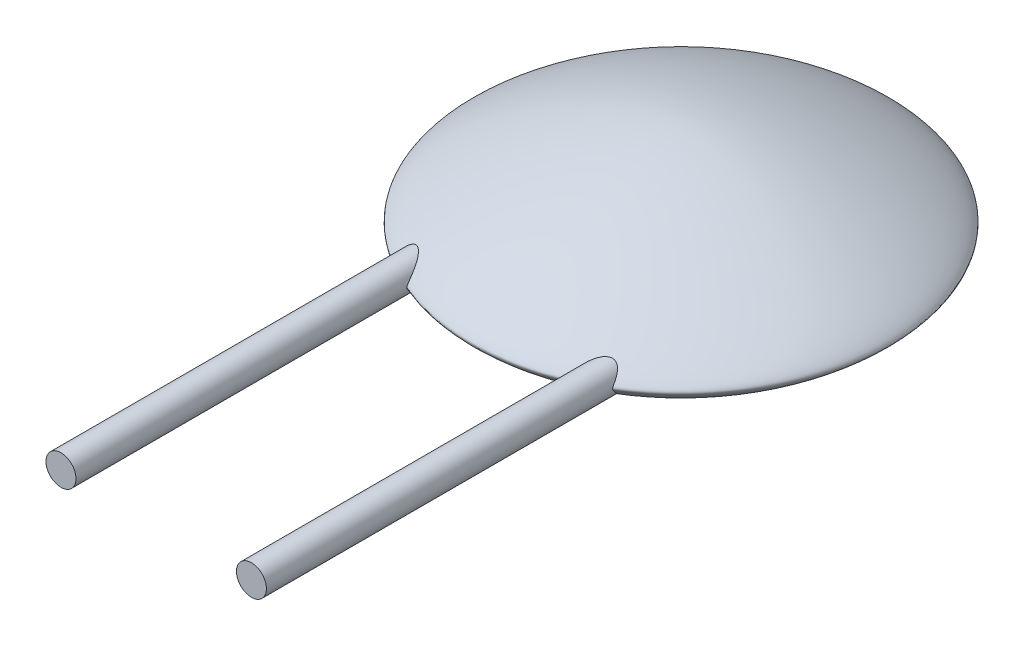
ISO-10303-21;
HEADER;
FILE_DESCRIPTION(('STEP AP214'),'2;1');
FILE_NAME('part.step','',(''),(''),'','','');
FILE_SCHEMA(('AUTOMOTIVE_DESIGN { 1 0 10303 214 1 1 1 1 }'));
ENDSEC;
DATA;
#1=APPLICATION_CONTEXT('core data for automotive mechanical design processes');
#2=APPLICATION_PROTOCOL_DEFINITION('international standard','automotive_design',2000,#1);
#3=PRODUCT_CONTEXT('',#1,'mechanical');
#4=PRODUCT('Part','Part','',(#3));
#5=PRODUCT_RELATED_PRODUCT_CATEGORY('part','',(#4));
#6=PRODUCT_DEFINITION_FORMATION('','',#4);
#7=PRODUCT_DEFINITION_CONTEXT('part definition',#1,'design');
#8=PRODUCT_DEFINITION('design','',#6,#7);
#9=PRODUCT_DEFINITION_SHAPE('','',#8);
#10=(LENGTH_UNIT() NAMED_UNIT(*) SI_UNIT(.MILLI.,.METRE.));
#11=(NAMED_UNIT(*) PLANE_ANGLE_UNIT() SI_UNIT($,.RADIAN.));
#12=(NAMED_UNIT(*) SI_UNIT($,.STERADIAN.) SOLID_ANGLE_UNIT());
#13=UNCERTAINTY_MEASURE_WITH_UNIT(LENGTH_MEASURE(1.E-05),#10,'distance_accuracy_value','');
#14=(GEOMETRIC_REPRESENTATION_CONTEXT(3) GLOBAL_UNCERTAINTY_ASSIGNED_CONTEXT((#13)) GLOBAL_UNIT_ASSIGNED_CONTEXT((#10,
#11,#12)) REPRESENTATION_CONTEXT('',''));
#15=CARTESIAN_POINT('',(0.,0.,0.));
#16=DIRECTION('',(0.,0.,1.));
#17=DIRECTION('',(1.,0.,0.));
#18=AXIS2_PLACEMENT_3D('',#15,#16,#17);
#19=CARTESIAN_POINT('',(0.,1.05,0.));
#20=CARTESIAN_POINT('',(-1.17248497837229,1.04999999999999,0.));
#21=CARTESIAN_POINT('',(-2.8,0.16193282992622,0.));
#22=CARTESIAN_POINT('',(-2.8,-0.16193282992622,0.));
#23=CARTESIAN_POINT('',(-1.2956675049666,-1.05,0.));
#24=CARTESIAN_POINT('',(0.,-1.05,0.));
#25=B_SPLINE_CURVE_WITH_KNOTS('',3,(#19,#20,#21,#22,#23,#24),.UNSPECIFIED.,.F.,.F.,(4,2,4),(0.,
0.5,1.),.UNSPECIFIED.);
#26=CARTESIAN_POINT('',(0.,1.05,0.));
#27=DIRECTION('',(0.,1.,0.));
#28=AXIS1_PLACEMENT('',#26,#27);
#29=SURFACE_OF_REVOLUTION('',#25,#28);
#30=CARTESIAN_POINT('',(1.47000000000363,0.,2.38308623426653));
#31=CARTESIAN_POINT('',(1.46999967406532,0.0037144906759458,2.3830677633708));
#32=CARTESIAN_POINT('',(1.46989144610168,0.00742089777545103,2.38215189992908));
#33=CARTESIAN_POINT('',(1.46947322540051,0.0151314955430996,2.3792964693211));
#34=CARTESIAN_POINT('',(1.4691278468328,0.0190516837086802,2.37719144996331));
#35=CARTESIAN_POINT('',(1.46825798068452,0.026604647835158,2.37252553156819));
#36=CARTESIAN_POINT('',(1.46773279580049,0.0302362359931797,2.36996287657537));
#37=CARTESIAN_POINT('',(1.46605837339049,0.0400254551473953,2.36251611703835));
#38=CARTESIAN_POINT('',(1.46474134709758,0.0459528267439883,2.35737566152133));
#39=CARTESIAN_POINT('',(1.46166454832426,0.0574419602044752,2.34682128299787));
#40=CARTESIAN_POINT('',(1.45990392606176,0.0630029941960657,2.34140685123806));
#41=CARTESIAN_POINT('',(1.45395505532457,0.0793507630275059,2.32499898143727));
#42=CARTESIAN_POINT('',(1.44910577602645,0.0897700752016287,2.31386955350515));
#43=CARTESIAN_POINT('',(1.43739431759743,0.110074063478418,2.29206232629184));
#44=CARTESIAN_POINT('',(1.43052219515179,0.119955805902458,2.28138706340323));
#45=CARTESIAN_POINT('',(1.41430596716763,0.139041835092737,2.2615025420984));
#46=CARTESIAN_POINT('',(1.40498460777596,0.148251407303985,2.25228098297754));
#47=CARTESIAN_POINT('',(1.38506181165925,0.163974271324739,2.23832270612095));
#48=CARTESIAN_POINT('',(1.37501084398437,0.170671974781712,2.23307313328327));
#49=CARTESIAN_POINT('',(1.35835411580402,0.179538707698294,2.22790199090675));
#50=CARTESIAN_POINT('',(1.35249504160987,0.18231176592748,2.2266295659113));
#51=CARTESIAN_POINT('',(1.34041669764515,0.187306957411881,2.22518087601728));
#52=CARTESIAN_POINT('',(1.33419785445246,0.189529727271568,2.22500333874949));
#53=CARTESIAN_POINT('',(1.32233866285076,0.193118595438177,2.2257422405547));
#54=CARTESIAN_POINT('',(1.31671079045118,0.194552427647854,2.22653934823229));
#55=CARTESIAN_POINT('',(1.30551924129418,0.19690411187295,2.22895871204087));
#56=CARTESIAN_POINT('',(1.29995570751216,0.197820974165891,2.23058253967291));
#57=CARTESIAN_POINT('',(1.28005556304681,0.200274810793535,2.23777048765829));
#58=CARTESIAN_POINT('',(1.26629751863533,0.200362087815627,2.24542884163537));
#59=CARTESIAN_POINT('',(1.24324630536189,0.198482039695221,2.26155224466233));
#60=CARTESIAN_POINT('',(1.23359562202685,0.196883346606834,2.26962107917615));
#61=CARTESIAN_POINT('',(1.21542939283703,0.192633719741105,2.28674149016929));
#62=CARTESIAN_POINT('',(1.20691674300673,0.189980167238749,2.29579547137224));
#63=CARTESIAN_POINT('',(1.18374390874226,0.18117867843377,2.32278046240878));
#64=CARTESIAN_POINT('',(1.17034619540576,0.174021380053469,2.34144767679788));
#65=CARTESIAN_POINT('',(1.14616991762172,0.157723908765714,2.37960538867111));
#66=CARTESIAN_POINT('',(1.13540091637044,0.148576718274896,2.39909859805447));
#67=CARTESIAN_POINT('',(1.11509610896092,0.127449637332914,2.44037694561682));
#68=CARTESIAN_POINT('',(1.10581030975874,0.115272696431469,2.46218689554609));
#69=CARTESIAN_POINT('',(1.09389818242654,0.0951199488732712,2.49440971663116));
#70=CARTESIAN_POINT('',(1.09026576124,0.0880944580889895,2.50505995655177));
#71=CARTESIAN_POINT('',(1.08371435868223,0.0732419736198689,2.52600950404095));
#72=CARTESIAN_POINT('',(1.08079413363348,0.0654164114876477,2.53630939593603));
#73=CARTESIAN_POINT('',(1.07695482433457,0.0524892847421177,2.5514477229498));
#74=CARTESIAN_POINT('',(1.07573914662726,0.0478290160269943,2.55658425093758));
#75=CARTESIAN_POINT('',(1.07358552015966,0.0380358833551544,2.56641055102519));
#76=CARTESIAN_POINT('',(1.07264620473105,0.0329055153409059,2.57110244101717));
#77=CARTESIAN_POINT('',(1.07134379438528,0.0234759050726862,2.57832353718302));
#78=CARTESIAN_POINT('',(1.07089242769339,0.0193812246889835,2.58108151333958));
#79=CARTESIAN_POINT('',(1.07043460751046,0.0132870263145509,2.58415881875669));
#80=CARTESIAN_POINT('',(1.07032479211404,0.0115353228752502,2.58493876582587));
#81=CARTESIAN_POINT('',(1.07014974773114,0.00794304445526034,2.58624351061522));
#82=CARTESIAN_POINT('',(1.07008425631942,0.00610306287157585,2.58676980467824));
#83=CARTESIAN_POINT('',(1.07001359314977,0.00275389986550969,2.58735975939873));
#84=CARTESIAN_POINT('',(1.0699984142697,0.00125960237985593,2.58749904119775));
#85=CARTESIAN_POINT('',(1.07000185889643,-0.00172709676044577,2.58747686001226));
#86=CARTESIAN_POINT('',(1.07002052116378,-0.00321949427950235,2.58731505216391));
#87=CARTESIAN_POINT('',(1.07010547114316,-0.0068427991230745,2.58665719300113));
#88=CARTESIAN_POINT('',(1.07018981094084,-0.00894936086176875,2.58604106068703));
#89=CARTESIAN_POINT('',(1.07041594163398,-0.0130559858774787,2.58451471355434));
#90=CARTESIAN_POINT('',(1.0705580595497,-0.0150553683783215,2.58360283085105));
#91=CARTESIAN_POINT('',(1.07118369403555,-0.0223954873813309,2.57982222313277));
#92=CARTESIAN_POINT('',(1.07182673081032,-0.0273977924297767,2.57634290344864));
#93=CARTESIAN_POINT('',(1.07337429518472,-0.0368965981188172,2.56882704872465));
#94=CARTESIAN_POINT('',(1.07427990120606,-0.0413909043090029,2.56478825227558));
#95=CARTESIAN_POINT('',(1.07689696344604,-0.0525418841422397,2.55395847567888));
#96=CARTESIAN_POINT('',(1.07877067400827,-0.058934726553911,2.54693376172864));
#97=CARTESIAN_POINT('',(1.08296877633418,-0.0711381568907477,2.5325168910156));
#98=CARTESIAN_POINT('',(1.08529412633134,-0.0769474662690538,2.52512397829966));
#99=CARTESIAN_POINT('',(1.09289308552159,-0.0937284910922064,2.50260626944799));
#100=CARTESIAN_POINT('',(1.09878018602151,-0.104017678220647,2.48718145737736));
#101=CARTESIAN_POINT('',(1.11571571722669,-0.128553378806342,2.44757864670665));
#102=CARTESIAN_POINT('',(1.12782102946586,-0.141858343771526,2.4232586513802));
#103=CARTESIAN_POINT('',(1.1488942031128,-0.159420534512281,2.38744991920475));
#104=CARTESIAN_POINT('',(1.15638184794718,-0.164864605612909,2.37565457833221));
#105=CARTESIAN_POINT('',(1.17246484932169,-0.174862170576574,2.35245794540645));
#106=CARTESIAN_POINT('',(1.1810595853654,-0.17941615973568,2.34105643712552));
#107=CARTESIAN_POINT('',(1.20245860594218,-0.18871992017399,2.31542838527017));
#108=CARTESIAN_POINT('',(1.21573949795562,-0.193087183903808,2.30143076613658));
#109=CARTESIAN_POINT('',(1.23785298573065,-0.197541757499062,2.28227030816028));
#110=CARTESIAN_POINT('',(1.24563867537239,-0.198677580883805,2.2761609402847));
#111=CARTESIAN_POINT('',(1.26196116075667,-0.200008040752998,2.26495020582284));
#112=CARTESIAN_POINT('',(1.27049599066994,-0.200205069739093,2.25984630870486));
#113=CARTESIAN_POINT('',(1.29106674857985,-0.199220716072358,2.24981534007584));
#114=CARTESIAN_POINT('',(1.30337730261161,-0.197601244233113,2.2454155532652));
#115=CARTESIAN_POINT('',(1.322007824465,-0.193228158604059,2.24175942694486));
#116=CARTESIAN_POINT('',(1.32827702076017,-0.191432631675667,2.24103517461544));
#117=CARTESIAN_POINT('',(1.34064007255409,-0.187223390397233,2.24063623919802));
#118=CARTESIAN_POINT('',(1.34673393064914,-0.18480968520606,2.24096154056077));
#119=CARTESIAN_POINT('',(1.36333291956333,-0.177272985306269,2.24329652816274));
#120=CARTESIAN_POINT('',(1.37340387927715,-0.171541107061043,2.24645906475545));
#121=CARTESIAN_POINT('',(1.39679225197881,-0.155646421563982,2.25743180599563));
#122=CARTESIAN_POINT('',(1.40880136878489,-0.144791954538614,2.26684846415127));
#123=CARTESIAN_POINT('',(1.42758368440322,-0.123835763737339,2.28631127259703));
#124=CARTESIAN_POINT('',(1.43486726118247,-0.113858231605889,2.29606099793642));
#125=CARTESIAN_POINT('',(1.44731853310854,-0.0932863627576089,2.31620778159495));
#126=CARTESIAN_POINT('',(1.45248991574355,-0.082693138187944,2.32660367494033));
#127=CARTESIAN_POINT('',(1.45847938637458,-0.067075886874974,2.34112770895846));
#128=CARTESIAN_POINT('',(1.46007249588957,-0.0624266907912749,2.34535823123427));
#129=CARTESIAN_POINT('',(1.46294836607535,-0.0528773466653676,2.35370298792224));
#130=CARTESIAN_POINT('',(1.46422918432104,-0.0479758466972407,2.35781636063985));
#131=CARTESIAN_POINT('',(1.46647252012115,-0.0377690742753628,2.36579903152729));
#132=CARTESIAN_POINT('',(1.46742991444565,-0.0324588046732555,2.36966368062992));
#133=CARTESIAN_POINT('',(1.46856250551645,-0.0240956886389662,2.37484731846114));
#134=CARTESIAN_POINT('',(1.46888858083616,-0.0212566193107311,2.3764664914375));
#135=CARTESIAN_POINT('',(1.46942805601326,-0.0154020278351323,2.37935633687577));
#136=CARTESIAN_POINT('',(1.46964161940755,-0.0123867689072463,2.38062751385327));
#137=CARTESIAN_POINT('',(1.46992461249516,-0.00623777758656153,2.38248569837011));
#138=CARTESIAN_POINT('',(1.47000027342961,-0.00311604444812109,2.3831017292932));
#139=CARTESIAN_POINT('',(1.47000000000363,0.,2.38308623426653));
#140=B_SPLINE_CURVE_WITH_KNOTS('',3,(#30,#31,#32,#33,#34,#35,#36,#37,#38,#39,#40,#41,#42,#43,
#44,#45,#46,#47,#48,#49,#50,#51,#52,#53,#54,#55,#56,#57,#58,#59,#60,#61,#62,#63,#64,#65,#66,#67,
#68,#69,#70,#71,#72,#73,#74,#75,#76,#77,#78,#79,#80,#81,#82,#83,#84,#85,#86,#87,#88,#89,#90,#91,
#92,#93,#94,#95,#96,#97,#98,#99,#100,#101,#102,#103,#104,#105,#106,#107,#108,#109,#110,#111,
#112,#113,#114,#115,#116,#117,#118,#119,#120,#121,#122,#123,#124,#125,#126,#127,#128,#129,#130,
#131,#132,#133,#134,#135,#136,#137,#138,#139),.UNSPECIFIED.,.T.,.F.,(4,2,2,2,2,2,2,2,2,2,2,2,2,
2,2,2,2,2,2,2,2,2,2,2,2,2,2,2,2,2,2,2,2,2,2,2,2,2,2,2,2,2,2,2,2,2,2,2,2,2,2,2,2,2,4),(0.,
0.0111621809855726,0.0245119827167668,0.0379141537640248,0.0617319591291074,0.0855957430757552,
0.13345252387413,0.181548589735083,0.22921287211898,0.268113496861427,0.287822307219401,
0.307508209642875,0.325007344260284,0.342539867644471,0.388830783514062,0.426752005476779,
0.464767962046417,0.536579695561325,0.608648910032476,0.688322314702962,0.728092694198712,
0.767793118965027,0.788895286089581,0.809891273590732,0.824662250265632,0.830411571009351,
0.83612654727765,0.840601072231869,0.845080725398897,0.851634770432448,0.858226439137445,
0.876465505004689,0.894780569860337,0.923755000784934,0.952791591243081,1.01102420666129,
1.10132900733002,1.146254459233,1.19115484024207,1.25006902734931,1.27985687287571,
1.30956876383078,1.34832979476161,1.36790587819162,1.38748167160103,1.42294649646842,
1.4781298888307,1.52519474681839,1.57217708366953,1.59162290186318,1.61118675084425,
1.63104737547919,1.64088142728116,1.65070114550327,1.66006497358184),.UNSPECIFIED.);
#141=CARTESIAN_POINT('',(1.47000000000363,0.,2.38308623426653));
#142=VERTEX_POINT('',#141);
#143=EDGE_CURVE('E11',#142,#142,#140,.T.);
#144=ORIENTED_EDGE('',*,*,#143,.F.);
#145=EDGE_LOOP('',(#144));
#146=FACE_BOUND('',#145,.T.);
#147=CARTESIAN_POINT('',(-1.07000000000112,0.,2.58748913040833));
#148=CARTESIAN_POINT('',(-1.07000007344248,0.0035103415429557,2.5874711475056));
#149=CARTESIAN_POINT('',(-1.0700971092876,0.00702169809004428,2.58662128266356));
#150=CARTESIAN_POINT('',(-1.07041537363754,0.0132211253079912,2.58427957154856));
#151=CARTESIAN_POINT('',(-1.07061950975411,0.0159572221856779,2.58288155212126));
#152=CARTESIAN_POINT('',(-1.07111315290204,0.0212332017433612,2.57975653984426));
#153=CARTESIAN_POINT('',(-1.07140274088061,0.0237728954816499,2.5780292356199));
#154=CARTESIAN_POINT('',(-1.07226853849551,0.0303236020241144,2.57315774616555));
#155=CARTESIAN_POINT('',(-1.07290725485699,0.0341892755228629,2.56983549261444));
#156=CARTESIAN_POINT('',(-1.07434210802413,0.0416192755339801,2.56289663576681));
#157=CARTESIAN_POINT('',(-1.07513856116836,0.0451829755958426,2.55927944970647));
#158=CARTESIAN_POINT('',(-1.07773991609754,0.0555649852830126,2.54812605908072));
#159=CARTESIAN_POINT('',(-1.07975131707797,0.0620379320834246,2.54031912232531));
#160=CARTESIAN_POINT('',(-1.08525949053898,0.0772174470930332,2.52073450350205));
#161=CARTESIAN_POINT('',(-1.08901458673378,0.0855886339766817,2.50877634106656));
#162=CARTESIAN_POINT('',(-1.09740659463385,0.101446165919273,2.48456948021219));
#163=CARTESIAN_POINT('',(-1.1020450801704,0.108930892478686,2.47232029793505));
#164=CARTESIAN_POINT('',(-1.11722017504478,0.130250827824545,2.4354907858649));
#165=CARTESIAN_POINT('',(-1.12903259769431,0.142993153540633,2.41077014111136));
#166=CARTESIAN_POINT('',(-1.15111463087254,0.161189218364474,2.3716400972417));
#167=CARTESIAN_POINT('',(-1.16019345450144,0.167548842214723,2.35696443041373));
#168=CARTESIAN_POINT('',(-1.1800307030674,0.178990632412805,2.32826965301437));
#169=CARTESIAN_POINT('',(-1.19078525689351,0.184075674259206,2.31424912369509));
#170=CARTESIAN_POINT('',(-1.20970824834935,0.190843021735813,2.29283846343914));
#171=CARTESIAN_POINT('',(-1.21719947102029,0.193073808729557,2.28503256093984));
#172=CARTESIAN_POINT('',(-1.23305361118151,0.196728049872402,2.27017658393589));
#173=CARTESIAN_POINT('',(-1.24141557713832,0.19815237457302,2.2631257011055));
#174=CARTESIAN_POINT('',(-1.26267378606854,0.200246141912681,2.24767217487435));
#175=CARTESIAN_POINT('',(-1.27607419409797,0.200411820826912,2.23979865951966));
#176=CARTESIAN_POINT('',(-1.29575451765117,0.198413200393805,2.23197621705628));
#177=CARTESIAN_POINT('',(-1.30141339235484,0.197603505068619,2.23011909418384));
#178=CARTESIAN_POINT('',(-1.31283467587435,0.195445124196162,2.22724673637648));
#179=CARTESIAN_POINT('',(-1.3185968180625,0.194097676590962,2.22622958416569));
#180=CARTESIAN_POINT('',(-1.33008757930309,0.190853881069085,2.22512623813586));
#181=CARTESIAN_POINT('',(-1.33581591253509,0.188954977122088,2.22504445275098));
#182=CARTESIAN_POINT('',(-1.34702183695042,0.184672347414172,2.22581464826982));
#183=CARTESIAN_POINT('',(-1.35249926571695,0.182288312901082,2.22666722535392));
#184=CARTESIAN_POINT('',(-1.37002044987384,0.1737242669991,2.23089411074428));
#185=CARTESIAN_POINT('',(-1.38120637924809,0.166681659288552,2.23611093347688));
#186=CARTESIAN_POINT('',(-1.39868029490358,0.15341313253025,2.24759147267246));
#187=CARTESIAN_POINT('',(-1.40550348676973,0.147367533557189,2.25334470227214));
#188=CARTESIAN_POINT('',(-1.41791099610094,0.134902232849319,2.26577636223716));
#189=CARTESIAN_POINT('',(-1.42349014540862,0.128481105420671,2.27245847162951));
#190=CARTESIAN_POINT('',(-1.43761563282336,0.110135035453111,2.29190207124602));
#191=CARTESIAN_POINT('',(-1.44496408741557,0.0979173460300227,2.30524975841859));
#192=CARTESIAN_POINT('',(-1.45393400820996,0.0788432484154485,2.32535242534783));
#193=CARTESIAN_POINT('',(-1.45658005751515,0.0723681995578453,2.3320593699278));
#194=CARTESIAN_POINT('',(-1.46122101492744,0.0590332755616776,2.34531240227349));
#195=CARTESIAN_POINT('',(-1.46321698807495,0.0521740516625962,2.35185873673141));
#196=CARTESIAN_POINT('',(-1.46549465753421,0.0422994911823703,2.36042809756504));
#197=CARTESIAN_POINT('',(-1.4660657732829,0.0395751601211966,2.36271014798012));
#198=CARTESIAN_POINT('',(-1.4671106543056,0.0339931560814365,2.36714635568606));
#199=CARTESIAN_POINT('',(-1.46758417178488,0.031135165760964,2.36930017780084));
#200=CARTESIAN_POINT('',(-1.46842632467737,0.0252180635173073,2.37340341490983));
#201=CARTESIAN_POINT('',(-1.46879397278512,0.0221573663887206,2.37535080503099));
#202=CARTESIAN_POINT('',(-1.46939989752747,0.0158115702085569,2.3788471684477));
#203=CARTESIAN_POINT('',(-1.46963868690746,0.0125274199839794,2.38039770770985));
#204=CARTESIAN_POINT('',(-1.469931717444,0.00601419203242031,2.38247631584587));
#205=CARTESIAN_POINT('',(-1.47000501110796,0.0028278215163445,2.38310651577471));
#206=CARTESIAN_POINT('',(-1.46999436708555,-0.00353345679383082,2.38306083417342));
#207=CARTESIAN_POINT('',(-1.46991006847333,-0.00670832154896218,2.38238195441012));
#208=CARTESIAN_POINT('',(-1.46956313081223,-0.0138448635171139,2.38012817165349));
#209=CARTESIAN_POINT('',(-1.46925001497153,-0.0177116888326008,2.37832858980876));
#210=CARTESIAN_POINT('',(-1.46844336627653,-0.0251832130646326,2.37425653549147));
#211=CARTESIAN_POINT('',(-1.4679489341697,-0.0287864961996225,2.37198173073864));
#212=CARTESIAN_POINT('',(-1.46639794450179,-0.0382737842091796,2.36549642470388));
#213=CARTESIAN_POINT('',(-1.46519107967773,-0.0439696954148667,2.36105420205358));
#214=CARTESIAN_POINT('',(-1.46236424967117,-0.0550296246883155,2.35189177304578));
#215=CARTESIAN_POINT('',(-1.46074350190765,-0.0603929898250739,2.34717105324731));
#216=CARTESIAN_POINT('',(-1.45526780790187,-0.0761632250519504,2.33284257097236));
#217=CARTESIAN_POINT('',(-1.45080312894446,-0.0862293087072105,2.3230852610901));
#218=CARTESIAN_POINT('',(-1.44008619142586,-0.105803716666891,2.30396115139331));
#219=CARTESIAN_POINT('',(-1.43383178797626,-0.115311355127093,2.29459483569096));
#220=CARTESIAN_POINT('',(-1.41921409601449,-0.133691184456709,2.2770416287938));
#221=CARTESIAN_POINT('',(-1.41086470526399,-0.142567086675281,2.26884750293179));
#222=CARTESIAN_POINT('',(-1.39194139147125,-0.158985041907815,2.25512818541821));
#223=CARTESIAN_POINT('',(-1.38149964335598,-0.166571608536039,2.24948998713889));
#224=CARTESIAN_POINT('',(-1.36404222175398,-0.176641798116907,2.2438627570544));
#225=CARTESIAN_POINT('',(-1.3578757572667,-0.179797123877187,2.24245903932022));
#226=CARTESIAN_POINT('',(-1.34511579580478,-0.185488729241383,2.24081779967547));
#227=CARTESIAN_POINT('',(-1.33852288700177,-0.188025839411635,2.24057870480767));
#228=CARTESIAN_POINT('',(-1.32599435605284,-0.192100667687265,2.24127714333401));
#229=CARTESIAN_POINT('',(-1.32007765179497,-0.193722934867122,2.24207354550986));
#230=CARTESIAN_POINT('',(-1.30828988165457,-0.196393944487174,2.24453539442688));
#231=CARTESIAN_POINT('',(-1.30241892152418,-0.197441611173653,2.24620245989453));
#232=CARTESIAN_POINT('',(-1.28173036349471,-0.200220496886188,2.25350546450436));
#233=CARTESIAN_POINT('',(-1.26744793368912,-0.200412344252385,2.26124858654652));
#234=CARTESIAN_POINT('',(-1.24367210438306,-0.198550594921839,2.27745974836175));
#235=CARTESIAN_POINT('',(-1.23378903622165,-0.196930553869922,2.28548682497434));
#236=CARTESIAN_POINT('',(-1.21515593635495,-0.192567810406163,2.30252755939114));
#237=CARTESIAN_POINT('',(-1.20640842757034,-0.189822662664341,2.31154333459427));
#238=CARTESIAN_POINT('',(-1.18312391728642,-0.180872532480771,2.33781449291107));
#239=CARTESIAN_POINT('',(-1.16974665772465,-0.173679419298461,2.35574476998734));
#240=CARTESIAN_POINT('',(-1.14553449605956,-0.157230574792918,2.39241632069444));
#241=CARTESIAN_POINT('',(-1.13471256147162,-0.147964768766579,2.41116118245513));
#242=CARTESIAN_POINT('',(-1.11441541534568,-0.126617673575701,2.45059864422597));
#243=CARTESIAN_POINT('',(-1.10516153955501,-0.114353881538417,2.47130911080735));
#244=CARTESIAN_POINT('',(-1.09332884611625,-0.0940585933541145,2.50176087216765));
#245=CARTESIAN_POINT('',(-1.08973506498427,-0.0870050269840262,2.51177494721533));
#246=CARTESIAN_POINT('',(-1.08326526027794,-0.0720900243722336,2.53142049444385));
#247=CARTESIAN_POINT('',(-1.0803877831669,-0.0642302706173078,2.54105270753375));
#248=CARTESIAN_POINT('',(-1.0769994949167,-0.0525524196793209,2.55372257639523));
#249=CARTESIAN_POINT('',(-1.07612835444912,-0.0492540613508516,2.55714222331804));
#250=CARTESIAN_POINT('',(-1.07451779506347,-0.042416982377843,2.56380074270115));
#251=CARTESIAN_POINT('',(-1.07377897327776,-0.0388772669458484,2.56703875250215));
#252=CARTESIAN_POINT('',(-1.07245180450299,-0.031449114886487,2.57323383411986));
#253=CARTESIAN_POINT('',(-1.07186542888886,-0.027556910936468,2.57618694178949));
#254=CARTESIAN_POINT('',(-1.07089676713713,-0.0193698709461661,2.58148352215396));
#255=CARTESIAN_POINT('',(-1.07051327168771,-0.0150776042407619,2.58383056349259));
#256=CARTESIAN_POINT('',(-1.07009863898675,-0.00708540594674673,2.58667789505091));
#257=CARTESIAN_POINT('',(-1.06999992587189,-0.00354322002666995,2.58750728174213));
#258=CARTESIAN_POINT('',(-1.07000000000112,0.,2.58748913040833));
#259=B_SPLINE_CURVE_WITH_KNOTS('',3,(#147,#148,#149,#150,#151,#152,#153,#154,#155,#156,#157,
#158,#159,#160,#161,#162,#163,#164,#165,#166,#167,#168,#169,#170,#171,#172,#173,#174,#175,#176,
#177,#178,#179,#180,#181,#182,#183,#184,#185,#186,#187,#188,#189,#190,#191,#192,#193,#194,#195,
#196,#197,#198,#199,#200,#201,#202,#203,#204,#205,#206,#207,#208,#209,#210,#211,#212,#213,#214,
#215,#216,#217,#218,#219,#220,#221,#222,#223,#224,#225,#226,#227,#228,#229,#230,#231,#232,#233,
#234,#235,#236,#237,#238,#239,#240,#241,#242,#243,#244,#245,#246,#247,#248,#249,#250,#251,#252,
#253,#254,#255,#256,#257,#258),.UNSPECIFIED.,.T.,.F.,(4,2,2,2,2,2,2,2,2,2,2,2,2,2,2,2,2,2,2,2,2,
2,2,2,2,2,2,2,2,2,2,2,2,2,2,2,2,2,2,2,2,2,2,2,2,2,2,2,2,2,2,2,2,2,2,4),(0.,0.010546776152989,
0.019771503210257,0.0290049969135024,0.0443819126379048,0.0597899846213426,0.0907492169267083,
0.135892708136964,0.181117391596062,0.271348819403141,0.326439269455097,0.381404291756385,
0.414466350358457,0.447492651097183,0.493269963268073,0.511231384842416,0.529151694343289,
0.547156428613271,0.565172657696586,0.606928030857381,0.639155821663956,0.671515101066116,
0.729767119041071,0.758828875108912,0.787842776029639,0.798637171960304,0.809458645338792,
0.820377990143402,0.831253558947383,0.840794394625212,0.850357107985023,0.863138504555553,
0.875984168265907,0.897909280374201,0.919876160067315,0.963890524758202,1.00795786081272,
1.05174025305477,1.09333245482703,1.11441723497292,1.13547352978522,1.15393946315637,
1.17243985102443,1.22019892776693,1.25857921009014,1.297043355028,1.36716149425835,
1.43762816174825,1.5147003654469,1.55296795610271,1.59115724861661,1.60564057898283,
1.62018770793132,1.63491452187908,1.64955253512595,1.66019809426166),.UNSPECIFIED.);
#260=CARTESIAN_POINT('',(-1.07000000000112,0.,2.58748913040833));
#261=VERTEX_POINT('',#260);
#262=EDGE_CURVE('E46',#261,#261,#259,.T.);
#263=ORIENTED_EDGE('',*,*,#262,.F.);
#264=EDGE_LOOP('',(#263));
#265=FACE_BOUND('',#264,.T.);
#266=CARTESIAN_POINT('',(0.,-1.05,0.));
#267=VERTEX_POINT('',#266);
#268=VERTEX_LOOP('',#267);
#269=FACE_BOUND('',#268,.T.);
#270=CARTESIAN_POINT('',(0.,1.05,0.));
#271=VERTEX_POINT('',#270);
#272=VERTEX_LOOP('',#271);
#273=FACE_BOUND('',#272,.T.);
#274=ADVANCED_FACE('F34',(#146,#265,#269,#273),#29,.F.);
#275=CARTESIAN_POINT('',(-1.27,0.,-500000.));
#276=DIRECTION('',(0.,0.,1.));
#277=DIRECTION('',(1.,0.,0.));
#278=AXIS2_PLACEMENT_3D('',#275,#276,#277);
#279=CYLINDRICAL_SURFACE('',#278,0.2);
#280=ORIENTED_EDGE('',*,*,#262,.T.);
#281=EDGE_LOOP('',(#280));
#282=FACE_BOUND('',#281,.T.);
#283=CARTESIAN_POINT('',(-1.27,0.,7.));
#284=DIRECTION('',(0.,0.,1.));
#285=DIRECTION('',(1.,0.,0.));
#286=AXIS2_PLACEMENT_3D('',#283,#284,#285);
#287=CIRCLE('',#286,0.2);
#288=CARTESIAN_POINT('',(-1.07,0.,7.));
#289=VERTEX_POINT('',#288);
#290=EDGE_CURVE('E64',#289,#289,#287,.T.);
#291=ORIENTED_EDGE('',*,*,#290,.F.);
#292=EDGE_LOOP('',(#291));
#293=FACE_BOUND('',#292,.T.);
#294=ADVANCED_FACE('F53',(#282,#293),#279,.T.);
#295=CARTESIAN_POINT('',(1.27,0.,-500000.));
#296=DIRECTION('',(0.,0.,1.));
#297=DIRECTION('',(1.,0.,0.));
#298=AXIS2_PLACEMENT_3D('',#295,#296,#297);
#299=CYLINDRICAL_SURFACE('',#298,0.2);
#300=ORIENTED_EDGE('',*,*,#143,.T.);
#301=EDGE_LOOP('',(#300));
#302=FACE_BOUND('',#301,.T.);
#303=CARTESIAN_POINT('',(1.27,0.,7.));
#304=DIRECTION('',(0.,0.,1.));
#305=DIRECTION('',(1.,0.,0.));
#306=AXIS2_PLACEMENT_3D('',#303,#304,#305);
#307=CIRCLE('',#306,0.20000000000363);
#308=CARTESIAN_POINT('',(1.47000000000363,0.,7.));
#309=VERTEX_POINT('',#308);
#310=EDGE_CURVE('E66',#309,#309,#307,.T.);
#311=ORIENTED_EDGE('',*,*,#310,.F.);
#312=EDGE_LOOP('',(#311));
#313=FACE_BOUND('',#312,.T.);
#314=ADVANCED_FACE('F58',(#302,#313),#299,.T.);
#315=CARTESIAN_POINT('',(-1.27,0.,7.));
#316=DIRECTION('',(0.,0.,1.));
#317=DIRECTION('',(1.,0.,0.));
#318=AXIS2_PLACEMENT_3D('',#315,#316,#317);
#319=PLANE('',#318);
#320=ORIENTED_EDGE('',*,*,#290,.T.);
#321=EDGE_LOOP('',(#320));
#322=FACE_BOUND('',#321,.T.);
#323=ADVANCED_FACE('F77',(#322),#319,.T.);
#324=CARTESIAN_POINT('',(1.27,0.,7.));
#325=DIRECTION('',(0.,0.,1.));
#326=DIRECTION('',(1.,0.,0.));
#327=AXIS2_PLACEMENT_3D('',#324,#325,#326);
#328=PLANE('',#327);
#329=ORIENTED_EDGE('',*,*,#310,.T.);
#330=EDGE_LOOP('',(#329));
#331=FACE_BOUND('',#330,.T.);
#332=ADVANCED_FACE('F81',(#331),#328,.T.);
#333=CLOSED_SHELL('',(#274,#294,#314,#323,#332));
#334=MANIFOLD_SOLID_BREP('B2',#333);
#335=ADVANCED_BREP_SHAPE_REPRESENTATION('',(#18,#334),#14);
#336=SHAPE_DEFINITION_REPRESENTATION(#9,#335);
ENDSEC;
END-ISO-10303-21;
